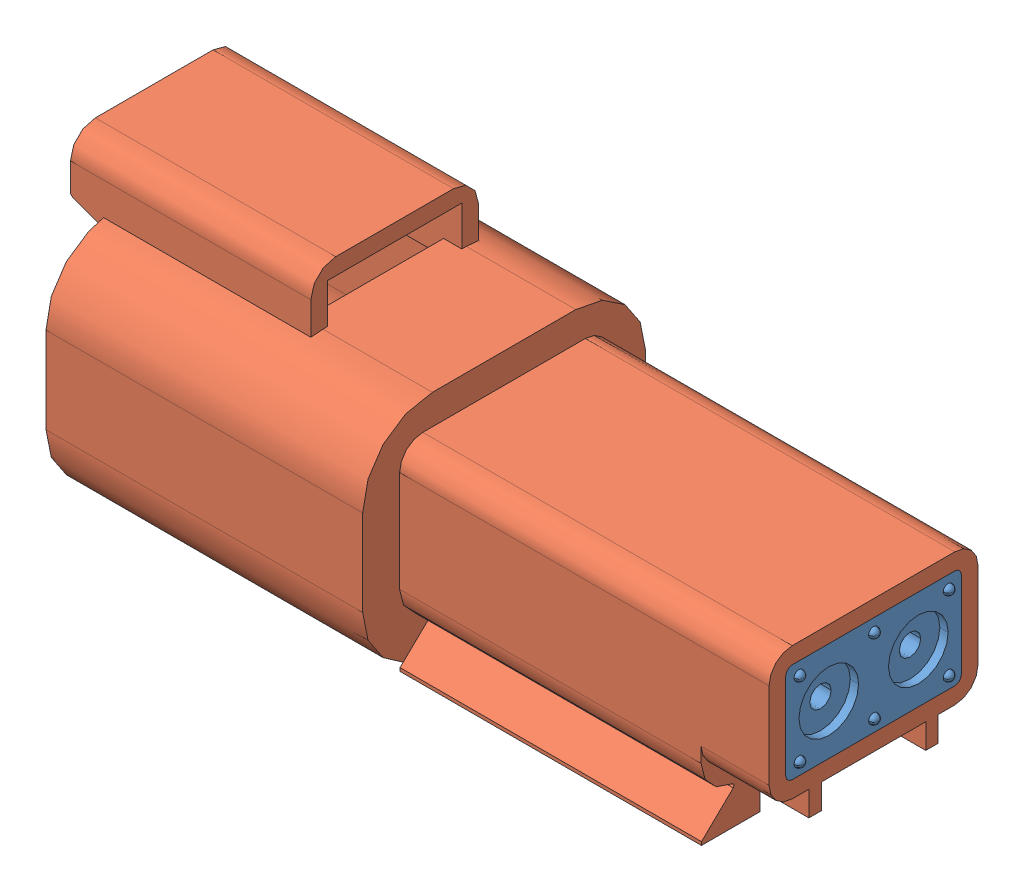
SolidWorks assembly AT04_2P.sldasm, configuration Default (file format 14000). Lengths in mm.
Overall size (43.68 17.5 17.05).
2 component instances, 2 part files, 0 mates.
Components (placement in the parent):
- AT04_2P_3-1: AT04_2P_3.sldprt [Default] at (44.18 1 0) x (0 0 -1) z (1 0 0) size (10.6 6 5.6)
- AT04_2P_5-1: AT04_2P_5.sldprt [Default] at origin size (43.38 17.5 17.05)
